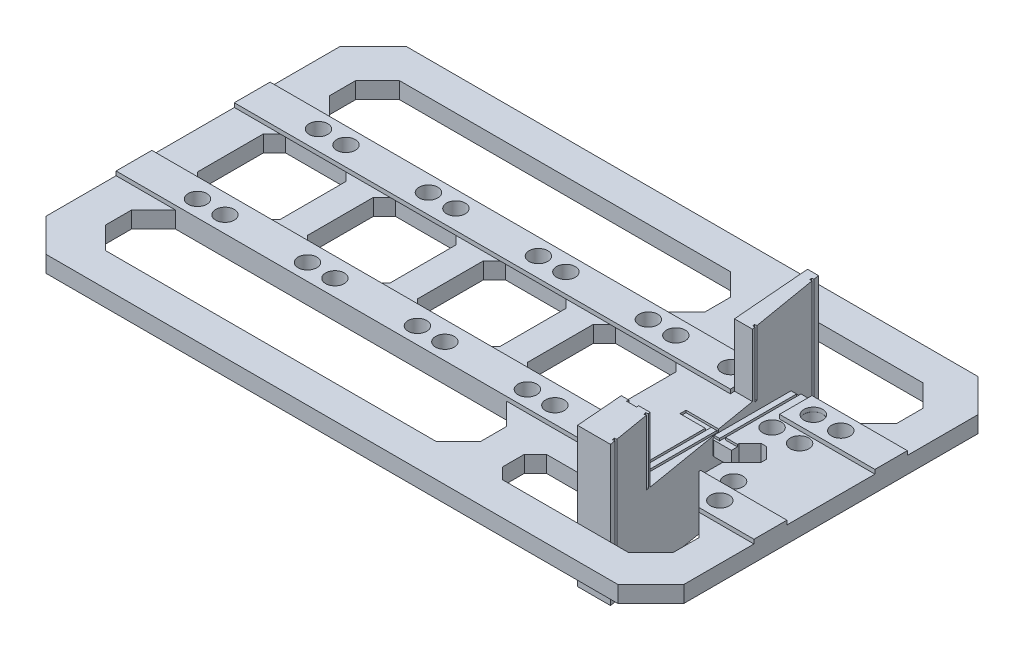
from build123d import *

# Parameters (mm, degrees)
SKETCH1_R           = 1.7
BOSS_EXTRUDE1_DEPTH = 3
SKETCH2_W           = 1
SKETCH2_H           = 14
CUT_EXTRUDE1_DEPTH  = 0.4
BOSS_EXTRUDE2_DEPTH = 11
BOSS_EXTRUDE3_DEPTH = 11.4
SKETCH9_W           = 0.4
SKETCH9_H           = 25.4
SKETCH9_H_2         = 12.2
CUT_EXTRUDE5_DEPTH  = 0.4
SKETCH10_W          = 1.8
SKETCH10_H          = 11.8
CUT_EXTRUDE6_DEPTH  = 0.4
SKETCH11_W          = 17.35
SKETCH11_H          = 5.9
SKETCH11_R          = 1.711275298
SKETCH11_R_2        = 1.7
SKETCH11_W_2        = 89.8
SKETCH11_H_2        = 6.5
BOSS_EXTRUDE4_DEPTH = 0.75


with BuildPart() as part:
    # Sketch1 → Boss-Extrude1 (new body)
    with BuildSketch(Plane(origin=(0, 0, 0), x_dir=(1, 0, 0), z_dir=(0, 1, 0))):
        Polygon((57, -32.75), (-47, -32.75), (-53, -26.75), (-53, 26.75), (-47, 32.75), (57, 32.75), (63, 26.75), (63, -26.75), align=None)
        with Locations(Location((51.3, -6, 0), (0, 0, 90))):
            Circle(SKETCH1_R, mode=Mode.SUBTRACT)
        with Locations(Location((51.3, 6, 0), (0, 0, 270))):
            Circle(SKETCH1_R, mode=Mode.SUBTRACT)
        with Locations(Location((33.8, -11, 0), (0, 0, 270))):
            Circle(SKETCH1_R, mode=Mode.SUBTRACT)
        with Locations(Location((46.3, 6, 0), (0, 0, 270))):
            Circle(SKETCH1_R, mode=Mode.SUBTRACT)
        with Locations(Location((23.8, 11, 0), (0, 0, 270))):
            Circle(SKETCH1_R, mode=Mode.SUBTRACT)
        with Locations(Location((18.8, 11, 0), (0, 0, 270))):
            Circle(SKETCH1_R, mode=Mode.SUBTRACT)
        with Locations(Location((3.8, 11, 0), (0, 0, 270))):
            Circle(SKETCH1_R, mode=Mode.SUBTRACT)
        with Locations(Location((-1.2, 11, 0), (0, 0, 270))):
            Circle(SKETCH1_R, mode=Mode.SUBTRACT)
        with Locations(Location((-16.2, 11, 0), (0, 0, 270))):
            Circle(SKETCH1_R, mode=Mode.SUBTRACT)
        with Locations(Location((-21.2, 11, 0), (0, 0, 270))):
            Circle(SKETCH1_R, mode=Mode.SUBTRACT)
        with Locations(Location((48.8, 11, 0), (0, 0, 270))):
            Circle(SKETCH1_R, mode=Mode.SUBTRACT)
        with Locations(Location((-36.2, 11, 0), (0, 0, 270))):
            Circle(SKETCH1_R, mode=Mode.SUBTRACT)
        with Locations(Location((-41.2, 11, 0), (0, 0, 270))):
            Circle(SKETCH1_R, mode=Mode.SUBTRACT)
        with Locations(Location((53.8, -11, 0), (0, 0, 90))):
            Circle(SKETCH1_R, mode=Mode.SUBTRACT)
        with Locations(Location((-41.2, -11, 0), (0, 0, 90))):
            Circle(SKETCH1_R, mode=Mode.SUBTRACT)
        with Locations(Location((-36.2, -11, 0), (0, 0, 90))):
            Circle(SKETCH1_R, mode=Mode.SUBTRACT)
        with Locations(Location((-21.2, -11, 0), (0, 0, 90))):
            Circle(SKETCH1_R, mode=Mode.SUBTRACT)
        with Locations(Location((53.8, 11, 0), (0, 0, 270))):
            Circle(SKETCH1_R, mode=Mode.SUBTRACT)
        with Locations(Location((-16.2, -11, 0), (0, 0, 90))):
            Circle(SKETCH1_R, mode=Mode.SUBTRACT)
        with Locations(Location((-1.2, -11, 0), (0, 0, 90))):
            Circle(SKETCH1_R, mode=Mode.SUBTRACT)
        with Locations(Location((3.8, -11, 0), (0, 0, 90))):
            Circle(SKETCH1_R, mode=Mode.SUBTRACT)
        with Locations(Location((18.8, -11, 0), (0, 0, 90))):
            Circle(SKETCH1_R, mode=Mode.SUBTRACT)
        with Locations(Location((23.8, -11, 0), (0, 0, 90))):
            Circle(SKETCH1_R, mode=Mode.SUBTRACT)
        with Locations(Location((33.8, 11, 0), (0, 0, 270))):
            Circle(SKETCH1_R, mode=Mode.SUBTRACT)
        Polygon((13.8, 6), (13.8, -6), (15.8, -8), (26.8, -8), (28.8, -6), (28.8, 6), (26.8, 8), (15.8, 8), align=None, mode=Mode.SUBTRACT)
        with BuildLine():
            Line((57, 17.9), (53, 13.9))
            Line((53, 13.9), (42.25, 13.9))
            ThreePointArc((42.25, 13.9), (41.967157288, 13.782842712), (41.85, 13.5))
            Line((41.85, 13.5), (41.85, 9.9))
            ThreePointArc((41.85, 9.9), (41.967157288, 9.617157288), (42.25, 9.5))
            Line((42.25, 9.5), (42.25, -0.5))
            ThreePointArc((42.25, -0.5), (42.367157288, -0.782842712), (42.65, -0.9))
            Line((42.65, -0.9), (45.8, -0.9))
            Line((45.8, -0.9), (45.8, 0.5))
            Line((45.8, 0.5), (47.8, 2.5))
            Line((47.8, 2.5), (48.8, 2.5))
            Line((48.8, 2.5), (50.8, 0.5))
            Line((50.8, 0.5), (50.8, -0.5))
            Line((50.8, -0.5), (47.3, -4))
            Line((47.3, -4), (47.3, -8.3))
            Line((47.3, -8.3), (57, -18))
            Line((57, -18), (57, -22.75))
            Line((57, -22.75), (53, -26.75))
            Line((53, -26.75), (30, -26.75))
            Line((30, -26.75), (28, -24.75))
            Line((28, -24.75), (28, -20.75))
            Line((28, -20.75), (30, -18.75))
            Line((30, -18.75), (39.346239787, -18.75))
            Line((39.346239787, -18.75), (39.668768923, -22.75))
            Line((39.668768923, -22.75), (45.668539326, -22.75))
            Line((45.668539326, -22.75), (38, 22.75))
            Line((38, 22.75), (36, 22.75))
            Line((36, 22.75), (36.322529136, 18.75))
            Line((36.322529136, 18.75), (30, 18.75))
            Line((30, 18.75), (28, 20.75))
            Line((28, 20.75), (28, 24.75))
            Line((28, 24.75), (30, 26.75))
            Line((30, 26.75), (53, 26.75))
            Line((53, 26.75), (57, 22.75))
            Line((57, 22.75), (57, 17.9))
        make_face(mode=Mode.SUBTRACT)
        Polygon((22, -18), (22, -22.75), (18, -26.75), (-42.2, -26.75), (-46.2, -22.75), (-46.2, -18), (-42.2, -14), (18, -14), align=None, mode=Mode.SUBTRACT)
        Polygon((-6.2, 6), (-6.2, -6), (-4.2, -8), (6.8, -8), (8.8, -6), (8.8, 6), (6.8, 8), (-4.2, 8), align=None, mode=Mode.SUBTRACT)
        Polygon((22, 18), (22, 22.75), (18, 26.75), (-42.2, 26.75), (-46.2, 22.75), (-46.2, 18), (-42.2, 14), (18, 14), align=None, mode=Mode.SUBTRACT)
        Polygon((-26.2, 6), (-26.2, -6), (-24.2, -8), (-13.2, -8), (-11.2, -6), (-11.2, 6), (-13.2, 8), (-24.2, 8), align=None, mode=Mode.SUBTRACT)
        Polygon((-46.2, 6), (-46.2, -6), (-44.2, -8), (-33.2, -8), (-31.2, -6), (-31.2, 6), (-33.2, 8), (-44.2, 8), align=None, mode=Mode.SUBTRACT)
    extrude(amount=BOSS_EXTRUDE1_DEPTH)

    # Sketch2 → Cut-Extrude1 (cut)
    with BuildSketch(Plane(origin=(0, 3, 0), x_dir=(1, 0, 0), z_dir=(0, 1, 0))):
        Polygon((43.65, 0.184270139), (48.25, 0.189312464), (48.25, -0.9), (44.225, -0.9), (44.225, -14.1), (40.35, -14.1), (40.35, -0.2), (35.75, -0.2), (35.75, 0.9), (41.8, 0.9), (41.8, 13.9), (43.65, 13.9), align=None)
        with Locations((41.25, -6.5)):
            Rectangle(SKETCH2_W, SKETCH2_H, mode=Mode.SUBTRACT)
        with Locations((42.75, 6.5)):
            Rectangle(SKETCH2_W, SKETCH2_H, mode=Mode.SUBTRACT)
    extrude(amount=-CUT_EXTRUDE1_DEPTH, mode=Mode.SUBTRACT)

    # Sketch5 → Boss-Extrude2 (add)
    with BuildSketch(Plane(origin=(0, 0, 0), x_dir=(1, 0, 0), z_dir=(0, 1, 0))):
        Polygon((45.668539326, -22.75), (38, 22.75), (36, 22.75), (39.668768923, -22.75), align=None)
    extrude(amount=-BOSS_EXTRUDE2_DEPTH)

    # Sketch7 → Boss-Extrude3 (add)
    with BuildSketch(Plane(origin=(0, 3, 0), x_dir=(1, 0, 0), z_dir=(0, 1, 0))):
        Polygon((38, 22.75), (40.435393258, 8.3), (37.165136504, 8.3), (36, 22.75), align=None)
        Polygon((45.668539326, -22.75), (39.668768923, -22.75), (38.971299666, -14.1), (44.210674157, -14.1), align=None)
    extrude(amount=BOSS_EXTRUDE3_DEPTH)

    # Sketch9 → Cut-Extrude5 (cut)
    with BuildSketch(Plane(origin=(40.678768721, 0, -6.855972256), x_dir=(-0.16619542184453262, 0, -0.9860928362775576), z_dir=(0.9860928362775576, 0, -0.16619542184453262))):
        with Locations((14.918185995, 1.7)):
            Rectangle(SKETCH9_W, SKETCH9_H)
        with Locations((-28.823514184, 1.7)):
            Rectangle(SKETCH9_W, SKETCH9_H)
        with Locations((-21.848699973, 8.7)):
            Rectangle(SKETCH9_W, SKETCH9_H_2)
        Polygon((2.464990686, 14.798503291), (2.064991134, 14.799101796), (2.046738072, 2.6), (2.44673852, 2.6), align=None)
    extrude(amount=-CUT_EXTRUDE5_DEPTH, mode=Mode.SUBTRACT)

    # Sketch10 → Cut-Extrude6 (cut)
    with BuildSketch(Plane(origin=(0, 0, 14.1), x_dir=(-1, 0, 0), z_dir=(0, 0, -1))):
        with Locations((-41.25, 8.5)):
            Rectangle(SKETCH10_W, SKETCH10_H)
    extrude(amount=-CUT_EXTRUDE6_DEPTH, mode=Mode.SUBTRACT)

    # Sketch11 → Boss-Extrude4 (add)
    # profile 1 of 4: a face of its own
    with BuildSketch(Plane(origin=(0, 3, 0), x_dir=(1, 0, 0), z_dir=(0, 1, 0))):
        with Locations((54.325, 10.95)):
            Rectangle(SKETCH11_W, SKETCH11_H)
        with Locations(Location((48.8, 11, 0), (0, 0, 270))):
            Circle(SKETCH11_R, mode=Mode.SUBTRACT)
        with Locations(Location((53.8, 11, 0), (0, 0, 270))):
            Circle(SKETCH11_R_2, mode=Mode.SUBTRACT)
    # profile 2 of 4: a face of its own
    with BuildSketch(Plane(origin=(0, 3, 0), x_dir=(1, 0, 0), z_dir=(0, 1, 0))):
        Polygon((53, -14), (47.3, -8.3), (47.3, -8), (63, -8), (63, -14), align=None)
        with Locations(Location((53.8, -11, 0), (0, 0, 90.000000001))):
            Circle(SKETCH11_R_2, mode=Mode.SUBTRACT)
    # profile 3 of 4: a face of its own
    with BuildSketch(Plane(origin=(0, 3, 0), x_dir=(1, 0, 0), z_dir=(0, 1, 0))):
        Polygon((-53, 7.5), (-53, 14), (36.705532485, 14), (37.229642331, 7.5), align=None)
        with Locations(Location((-41.2, 11, 0), (0, 0, 270))):
            Circle(SKETCH11_R_2, mode=Mode.SUBTRACT)
        with Locations(Location((-36.2, 11, 0), (0, 0, 270))):
            Circle(SKETCH11_R_2, mode=Mode.SUBTRACT)
        with Locations(Location((-21.2, 11, 0), (0, 0, 270))):
            Circle(SKETCH11_R_2, mode=Mode.SUBTRACT)
        with Locations(Location((-16.2, 11, 0), (0, 0, 270))):
            Circle(SKETCH11_R_2, mode=Mode.SUBTRACT)
        with Locations(Location((-1.2, 11, 0), (0, 0, 270))):
            Circle(SKETCH11_R_2, mode=Mode.SUBTRACT)
        with Locations(Location((3.8, 11, 0), (0, 0, 270))):
            Circle(SKETCH11_R_2, mode=Mode.SUBTRACT)
        with Locations(Location((18.8, 11, 0), (0, 0, 270))):
            Circle(SKETCH11_R_2, mode=Mode.SUBTRACT)
        with Locations(Location((23.8, 11, 0), (0, 0, 270))):
            Circle(SKETCH11_R_2, mode=Mode.SUBTRACT)
        with Locations(Location((33.8, 11, 0), (0, 0, 270))):
            Circle(SKETCH11_R_2, mode=Mode.SUBTRACT)
    # profile 4 of 4: a face of its own
    with BuildSketch(Plane(origin=(0, 3, 0), x_dir=(1, 0, 0), z_dir=(0, 1, 0))):
        with Locations((-8.1, -10.75)):
            Rectangle(SKETCH11_W_2, SKETCH11_H_2)
        with Locations(Location((-41.2, -11, 0), (0, 0, 90))):
            Circle(SKETCH11_R_2, mode=Mode.SUBTRACT)
        with Locations(Location((-36.2, -11, 0), (0, 0, 90))):
            Circle(SKETCH11_R_2, mode=Mode.SUBTRACT)
        with Locations(Location((-21.2, -11, 0), (0, 0, 90))):
            Circle(SKETCH11_R_2, mode=Mode.SUBTRACT)
        with Locations(Location((-16.2, -11, 0), (0, 0, 90))):
            Circle(SKETCH11_R_2, mode=Mode.SUBTRACT)
        with Locations(Location((-1.2, -11, 0), (0, 0, 90))):
            Circle(SKETCH11_R_2, mode=Mode.SUBTRACT)
        with Locations(Location((3.8, -11, 0), (0, 0, 90))):
            Circle(SKETCH11_R_2, mode=Mode.SUBTRACT)
        with Locations(Location((18.8, -11, 0), (0, 0, 90))):
            Circle(SKETCH11_R_2, mode=Mode.SUBTRACT)
        with Locations(Location((23.8, -11, 0), (0, 0, 90))):
            Circle(SKETCH11_R_2, mode=Mode.SUBTRACT)
        with Locations(Location((33.8, -11, 0), (0, 0, 270))):
            Circle(SKETCH11_R_2, mode=Mode.SUBTRACT)
    extrude(amount=BOSS_EXTRUDE4_DEPTH)


solid = part.part
